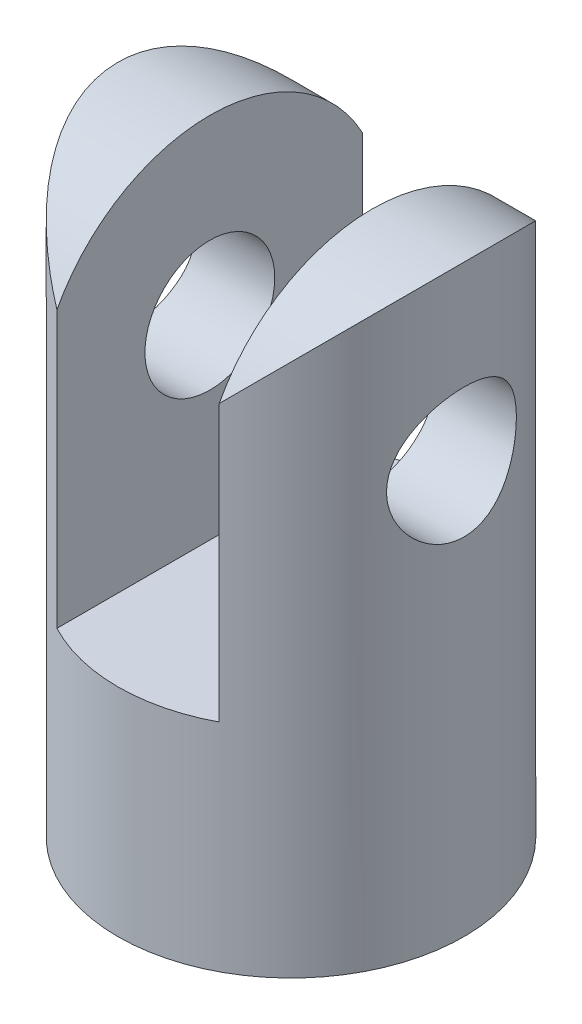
ISO-10303-21;
HEADER;
FILE_DESCRIPTION(('STEP AP214'),'2;1');
FILE_NAME('part.step','',(''),(''),'','','');
FILE_SCHEMA(('AUTOMOTIVE_DESIGN { 1 0 10303 214 1 1 1 1 }'));
ENDSEC;
DATA;
#1=APPLICATION_CONTEXT('core data for automotive mechanical design processes');
#2=APPLICATION_PROTOCOL_DEFINITION('international standard','automotive_design',2000,#1);
#3=PRODUCT_CONTEXT('',#1,'mechanical');
#4=PRODUCT('Part','Part','',(#3));
#5=PRODUCT_RELATED_PRODUCT_CATEGORY('part','',(#4));
#6=PRODUCT_DEFINITION_FORMATION('','',#4);
#7=PRODUCT_DEFINITION_CONTEXT('part definition',#1,'design');
#8=PRODUCT_DEFINITION('design','',#6,#7);
#9=PRODUCT_DEFINITION_SHAPE('','',#8);
#10=(LENGTH_UNIT() NAMED_UNIT(*) SI_UNIT(.MILLI.,.METRE.));
#11=(NAMED_UNIT(*) PLANE_ANGLE_UNIT() SI_UNIT($,.RADIAN.));
#12=(NAMED_UNIT(*) SI_UNIT($,.STERADIAN.) SOLID_ANGLE_UNIT());
#13=UNCERTAINTY_MEASURE_WITH_UNIT(LENGTH_MEASURE(1.E-05),#10,'distance_accuracy_value','');
#14=(GEOMETRIC_REPRESENTATION_CONTEXT(3) GLOBAL_UNCERTAINTY_ASSIGNED_CONTEXT((#13)) GLOBAL_UNIT_ASSIGNED_CONTEXT((#10,
#11,#12)) REPRESENTATION_CONTEXT('',''));
#15=CARTESIAN_POINT('',(0.,0.,0.));
#16=DIRECTION('',(0.,0.,1.));
#17=DIRECTION('',(1.,0.,0.));
#18=AXIS2_PLACEMENT_3D('',#15,#16,#17);
#19=CARTESIAN_POINT('',(0.,9.99999905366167,-2.));
#20=DIRECTION('',(0.,1.,0.));
#21=DIRECTION('',(0.,0.,1.));
#22=AXIS2_PLACEMENT_3D('',#19,#20,#21);
#23=CONICAL_SURFACE('',#22,3.49999522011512,0.785397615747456);
#24=CARTESIAN_POINT('',(0.,9.99999905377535,-2.));
#25=DIRECTION('',(0.,1.,0.));
#26=DIRECTION('',(0.,0.,1.));
#27=AXIS2_PLACEMENT_3D('',#24,#25,#26);
#28=CIRCLE('',#27,3.49999522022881);
#29=CARTESIAN_POINT('',(0.,9.99999905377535,1.49999522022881));
#30=VERTEX_POINT('',#29);
#31=EDGE_CURVE('E77',#30,#30,#28,.T.);
#32=ORIENTED_EDGE('',*,*,#31,.T.);
#33=EDGE_LOOP('',(#32));
#34=FACE_BOUND('',#33,.T.);
#35=CARTESIAN_POINT('',(0.,8.500002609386,-2.));
#36=DIRECTION('',(0.,1.,0.));
#37=DIRECTION('',(0.,0.,1.));
#38=AXIS2_PLACEMENT_3D('',#35,#36,#37);
#39=CIRCLE('',#38,2.);
#40=CARTESIAN_POINT('',(0.,8.500002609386,0.));
#41=VERTEX_POINT('',#40);
#42=EDGE_CURVE('E88',#41,#41,#39,.F.);
#43=ORIENTED_EDGE('',*,*,#42,.T.);
#44=EDGE_LOOP('',(#43));
#45=FACE_BOUND('',#44,.T.);
#46=ADVANCED_FACE('F16',(#34,#45),#23,.F.);
#47=CARTESIAN_POINT('',(-9.6,19.,0.));
#48=DIRECTION('',(1.,0.,0.));
#49=DIRECTION('',(0.,0.,-1.));
#50=AXIS2_PLACEMENT_3D('',#47,#48,#49);
#51=CYLINDRICAL_SURFACE('',#50,8.);
#52=CARTESIAN_POINT('',(-3.749999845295,19.,0.));
#53=DIRECTION('',(1.,0.,0.));
#54=DIRECTION('',(0.,0.,-1.));
#55=AXIS2_PLACEMENT_3D('',#52,#53,#54);
#56=CIRCLE('',#55,8.);
#57=CARTESIAN_POINT('',(-3.74999983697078,22.7499998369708,7.06664709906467));
#58=VERTEX_POINT('',#57);
#59=CARTESIAN_POINT('',(-3.74999968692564,22.7499996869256,-7.06664717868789));
#60=VERTEX_POINT('',#59);
#61=EDGE_CURVE('E21',#58,#60,#56,.F.);
#62=ORIENTED_EDGE('',*,*,#61,.T.);
#63=CARTESIAN_POINT('',(0.,19.,0.));
#64=DIRECTION('',(0.707106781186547,0.707106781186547,0.));
#65=DIRECTION('',(-0.707106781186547,0.707106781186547,0.));
#66=AXIS2_PLACEMENT_3D('',#63,#64,#65);
#67=ELLIPSE('',#66,11.3137084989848,8.);
#68=EDGE_CURVE('E61',#58,#60,#67,.F.);
#69=ORIENTED_EDGE('',*,*,#68,.F.);
#70=EDGE_LOOP('',(#62,#69));
#71=FACE_BOUND('',#70,.T.);
#72=ADVANCED_FACE('F59',(#71),#51,.T.);
#73=CARTESIAN_POINT('',(-3.75,27.,-9.6));
#74=DIRECTION('',(-1.,0.,0.));
#75=DIRECTION('',(0.,0.,1.));
#76=AXIS2_PLACEMENT_3D('',#73,#74,#75);
#77=PLANE('',#76);
#78=CARTESIAN_POINT('',(-3.75,19.,0.));
#79=DIRECTION('',(1.,0.,0.));
#80=DIRECTION('',(0.,0.,-1.));
#81=AXIS2_PLACEMENT_3D('',#78,#79,#80);
#82=CIRCLE('',#81,3.);
#83=CARTESIAN_POINT('',(-3.75,19.,-3.));
#84=VERTEX_POINT('',#83);
#85=EDGE_CURVE('E63',#84,#84,#82,.F.);
#86=ORIENTED_EDGE('',*,*,#85,.T.);
#87=EDGE_LOOP('',(#86));
#88=FACE_BOUND('',#87,.T.);
#89=DIRECTION('',(0.,1.,0.));
#90=VECTOR('',#89,1.);
#91=CARTESIAN_POINT('',(-3.74999952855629,0.,-7.06664726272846));
#92=LINE('',#91,#90);
#93=CARTESIAN_POINT('',(-3.74999972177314,10.,-7.06664716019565));
#94=VERTEX_POINT('',#93);
#95=EDGE_CURVE('E66',#60,#94,#92,.F.);
#96=ORIENTED_EDGE('',*,*,#95,.F.);
#97=ORIENTED_EDGE('',*,*,#61,.F.);
#98=DIRECTION('',(0.,1.,0.));
#99=VECTOR('',#98,1.);
#100=CARTESIAN_POINT('',(-3.74999982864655,0.,7.06664710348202));
#101=LINE('',#100,#99);
#102=CARTESIAN_POINT('',(-3.74999987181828,10.,7.06664708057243));
#103=VERTEX_POINT('',#102);
#104=EDGE_CURVE('E75',#103,#58,#101,.T.);
#105=ORIENTED_EDGE('',*,*,#104,.F.);
#106=DIRECTION('',(0.,0.,-1.));
#107=VECTOR('',#106,1.);
#108=CARTESIAN_POINT('',(-3.74999991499,10.,-9.6));
#109=LINE('',#108,#107);
#110=EDGE_CURVE('E69',#103,#94,#109,.T.);
#111=ORIENTED_EDGE('',*,*,#110,.T.);
#112=EDGE_LOOP('',(#96,#97,#105,#111));
#113=FACE_BOUND('',#112,.T.);
#114=ADVANCED_FACE('F67',(#88,#113),#77,.F.);
#115=CARTESIAN_POINT('',(-9.6,19.,0.));
#116=DIRECTION('',(1.,0.,0.));
#117=DIRECTION('',(0.,0.,-1.));
#118=AXIS2_PLACEMENT_3D('',#115,#116,#117);
#119=CYLINDRICAL_SURFACE('',#118,3.);
#120=ORIENTED_EDGE('',*,*,#85,.F.);
#121=EDGE_LOOP('',(#120));
#122=FACE_BOUND('',#121,.T.);
#123=CARTESIAN_POINT('',(-7.41619848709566,19.,-3.));
#124=CARTESIAN_POINT('',(-7.41620900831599,19.161766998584,-2.9999884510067));
#125=CARTESIAN_POINT('',(-7.42156067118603,19.3236956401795,-2.98684876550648));
#126=CARTESIAN_POINT('',(-7.44229400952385,19.6428323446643,-2.93479153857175));
#127=CARTESIAN_POINT('',(-7.45769160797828,19.8000324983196,-2.89583307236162));
#128=CARTESIAN_POINT('',(-7.49651371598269,20.1047659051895,-2.79378407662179));
#129=CARTESIAN_POINT('',(-7.51991367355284,20.2523271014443,-2.73076729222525));
#130=CARTESIAN_POINT('',(-7.57207117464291,20.534787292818,-2.58261142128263));
#131=CARTESIAN_POINT('',(-7.60082869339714,20.669686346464,-2.49747243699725));
#132=CARTESIAN_POINT('',(-7.66207090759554,20.9297771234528,-2.30293527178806));
#133=CARTESIAN_POINT('',(-7.6946654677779,21.0542515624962,-2.19261232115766));
#134=CARTESIAN_POINT('',(-7.75899363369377,21.2834413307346,-1.95279723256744));
#135=CARTESIAN_POINT('',(-7.79072701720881,21.3881516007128,-1.82330020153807));
#136=CARTESIAN_POINT('',(-7.85105749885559,21.5782790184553,-1.54338924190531));
#137=CARTESIAN_POINT('',(-7.87951124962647,21.662919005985,-1.39241376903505));
#138=CARTESIAN_POINT('',(-7.92876017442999,21.8053024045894,-1.07711141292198));
#139=CARTESIAN_POINT('',(-7.94955801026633,21.8630551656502,-0.912789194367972));
#140=CARTESIAN_POINT('',(-7.98037394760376,21.9475158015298,-0.582978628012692));
#141=CARTESIAN_POINT('',(-7.99081831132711,21.9754552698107,-0.417846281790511));
#142=CARTESIAN_POINT('',(-8.00128028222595,22.00344240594,-0.0849286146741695));
#143=CARTESIAN_POINT('',(-8.00130128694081,22.0034991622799,0.0828558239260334));
#144=CARTESIAN_POINT('',(-7.9911853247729,21.976436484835,0.407486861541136));
#145=CARTESIAN_POINT('',(-7.98155086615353,21.9506614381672,0.564463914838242));
#146=CARTESIAN_POINT('',(-7.95386555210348,21.8749283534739,0.871677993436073));
#147=CARTESIAN_POINT('',(-7.93581407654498,21.8249685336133,1.02191452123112));
#148=CARTESIAN_POINT('',(-7.89275490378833,21.7016575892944,1.3139812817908));
#149=CARTESIAN_POINT('',(-7.86764966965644,21.6279762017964,1.45565710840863));
#150=CARTESIAN_POINT('',(-7.8130249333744,21.4596122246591,1.72497867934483));
#151=CARTESIAN_POINT('',(-7.78350420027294,21.3649237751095,1.85262049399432));
#152=CARTESIAN_POINT('',(-7.72105535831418,21.1507598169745,2.09816242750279));
#153=CARTESIAN_POINT('',(-7.68802893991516,21.0301600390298,2.21505893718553));
#154=CARTESIAN_POINT('',(-7.62365902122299,20.7708645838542,2.42737704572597));
#155=CARTESIAN_POINT('',(-7.59231646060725,20.6321589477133,2.5227867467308));
#156=CARTESIAN_POINT('',(-7.53422933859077,20.3364085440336,2.69138801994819));
#157=CARTESIAN_POINT('',(-7.50760626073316,20.1790170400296,2.76402185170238));
#158=CARTESIAN_POINT('',(-7.47444443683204,19.9348088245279,2.85195371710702));
#159=CARTESIAN_POINT('',(-7.46452220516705,19.8520912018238,2.87775437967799));
#160=CARTESIAN_POINT('',(-7.44725488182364,19.6844945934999,2.92215114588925));
#161=CARTESIAN_POINT('',(-7.43990861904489,19.599616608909,2.9407505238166));
#162=CARTESIAN_POINT('',(-7.42813342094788,19.4293027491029,2.97036830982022));
#163=CARTESIAN_POINT('',(-7.42367360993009,19.3438829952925,2.98146700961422));
#164=CARTESIAN_POINT('',(-7.41770334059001,19.172324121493,2.99628593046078));
#165=CARTESIAN_POINT('',(-7.41619288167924,19.0861850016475,3.00000615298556));
#166=CARTESIAN_POINT('',(-7.41620900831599,18.838233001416,2.9999884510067));
#167=CARTESIAN_POINT('',(-7.42156067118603,18.6763043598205,2.98684876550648));
#168=CARTESIAN_POINT('',(-7.44229400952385,18.3571676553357,2.93479153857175));
#169=CARTESIAN_POINT('',(-7.45769160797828,18.1999675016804,2.89583307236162));
#170=CARTESIAN_POINT('',(-7.49651371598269,17.8952340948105,2.79378407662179));
#171=CARTESIAN_POINT('',(-7.51991367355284,17.7476728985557,2.73076729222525));
#172=CARTESIAN_POINT('',(-7.57207117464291,17.4652127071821,2.58261142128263));
#173=CARTESIAN_POINT('',(-7.60082869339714,17.330313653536,2.49747243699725));
#174=CARTESIAN_POINT('',(-7.66207090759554,17.0702228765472,2.30293527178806));
#175=CARTESIAN_POINT('',(-7.6946654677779,16.9457484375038,2.19261232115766));
#176=CARTESIAN_POINT('',(-7.75899363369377,16.7165586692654,1.95279723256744));
#177=CARTESIAN_POINT('',(-7.79072701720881,16.6118483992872,1.82330020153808));
#178=CARTESIAN_POINT('',(-7.85105749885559,16.4217209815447,1.54338924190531));
#179=CARTESIAN_POINT('',(-7.87951124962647,16.337080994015,1.39241376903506));
#180=CARTESIAN_POINT('',(-7.92876017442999,16.1946975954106,1.07711141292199));
#181=CARTESIAN_POINT('',(-7.94955801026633,16.1369448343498,0.912789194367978));
#182=CARTESIAN_POINT('',(-7.98037394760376,16.0524841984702,0.582978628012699));
#183=CARTESIAN_POINT('',(-7.99081831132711,16.0245447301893,0.417846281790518));
#184=CARTESIAN_POINT('',(-8.00128028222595,15.99655759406,0.0849286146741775));
#185=CARTESIAN_POINT('',(-8.00130128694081,15.9965008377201,-0.0828558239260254));
#186=CARTESIAN_POINT('',(-7.9911853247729,16.023563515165,-0.407486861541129));
#187=CARTESIAN_POINT('',(-7.98155086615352,16.0493385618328,-0.564463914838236));
#188=CARTESIAN_POINT('',(-7.95386555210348,16.1250716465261,-0.871677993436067));
#189=CARTESIAN_POINT('',(-7.93581407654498,16.1750314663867,-1.02191452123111));
#190=CARTESIAN_POINT('',(-7.89275490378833,16.2983424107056,-1.3139812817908));
#191=CARTESIAN_POINT('',(-7.86764966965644,16.3720237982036,-1.45565710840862));
#192=CARTESIAN_POINT('',(-7.8130249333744,16.5403877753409,-1.72497867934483));
#193=CARTESIAN_POINT('',(-7.78350420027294,16.6350762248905,-1.85262049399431));
#194=CARTESIAN_POINT('',(-7.72105535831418,16.8492401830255,-2.09816242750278));
#195=CARTESIAN_POINT('',(-7.68802893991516,16.9698399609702,-2.21505893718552));
#196=CARTESIAN_POINT('',(-7.623659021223,17.2291354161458,-2.42737704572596));
#197=CARTESIAN_POINT('',(-7.59231646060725,17.3678410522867,-2.5227867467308));
#198=CARTESIAN_POINT('',(-7.53422933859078,17.6635914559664,-2.69138801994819));
#199=CARTESIAN_POINT('',(-7.50760626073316,17.8209829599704,-2.76402185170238));
#200=CARTESIAN_POINT('',(-7.47444443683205,18.0651911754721,-2.85195371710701));
#201=CARTESIAN_POINT('',(-7.46452220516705,18.1479087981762,-2.87775437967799));
#202=CARTESIAN_POINT('',(-7.44725488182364,18.3155054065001,-2.92215114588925));
#203=CARTESIAN_POINT('',(-7.43990861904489,18.400383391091,-2.9407505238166));
#204=CARTESIAN_POINT('',(-7.42813342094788,18.5706972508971,-2.97036830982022));
#205=CARTESIAN_POINT('',(-7.42367360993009,18.6561170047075,-2.98146700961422));
#206=CARTESIAN_POINT('',(-7.41770334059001,18.827675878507,-2.99628593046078));
#207=CARTESIAN_POINT('',(-7.41619288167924,18.9138149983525,-3.00000615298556));
#208=CARTESIAN_POINT('',(-7.41619848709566,19.,-3.));
#209=B_SPLINE_CURVE_WITH_KNOTS('',3,(#123,#124,#125,#126,#127,#128,#129,#130,#131,#132,#133,
#134,#135,#136,#137,#138,#139,#140,#141,#142,#143,#144,#145,#146,#147,#148,#149,#150,#151,#152,
#153,#154,#155,#156,#157,#158,#159,#160,#161,#162,#163,#164,#165,#166,#167,#168,#169,#170,#171,
#172,#173,#174,#175,#176,#177,#178,#179,#180,#181,#182,#183,#184,#185,#186,#187,#188,#189,#190,
#191,#192,#193,#194,#195,#196,#197,#198,#199,#200,#201,#202,#203,#204,#205,#206,#207,#208),
.UNSPECIFIED.,.T.,.F.,(4,2,2,2,2,2,2,2,2,2,2,2,2,2,2,2,2,2,2,2,2,2,2,2,2,2,2,2,2,2,2,2,2,2,2,2,
2,2,2,2,2,2,4),(0.,0.484976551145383,0.970723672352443,1.45499365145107,1.93926139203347,
2.44548229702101,2.95183260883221,3.47540168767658,3.99878856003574,4.49960057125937,
5.00024934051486,5.47612880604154,5.95204333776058,6.43489319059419,6.91787790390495,
7.42905646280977,7.9405173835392,8.46366981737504,8.72501356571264,8.98623834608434,
9.24462054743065,9.50300269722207,9.98797924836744,10.4737263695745,10.9579963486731,
11.4422640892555,11.9484849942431,12.4548353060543,12.9784043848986,13.5017912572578,
14.0026032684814,14.5032520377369,14.9791315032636,15.4550460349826,15.9378958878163,
16.420880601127,16.9320591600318,17.4435200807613,17.9666725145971,18.2280162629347,
18.4892410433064,18.7476232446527,19.0060053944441),.UNSPECIFIED.);
#210=CARTESIAN_POINT('',(-7.41619848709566,19.,-3.));
#211=VERTEX_POINT('',#210);
#212=EDGE_CURVE('E72',#211,#211,#209,.T.);
#213=ORIENTED_EDGE('',*,*,#212,.F.);
#214=EDGE_LOOP('',(#213));
#215=FACE_BOUND('',#214,.T.);
#216=ADVANCED_FACE('F126',(#122,#215),#119,.F.);
#217=CARTESIAN_POINT('',(0.,0.,-2.));
#218=DIRECTION('',(0.,1.,0.));
#219=DIRECTION('',(0.,0.,1.));
#220=AXIS2_PLACEMENT_3D('',#217,#218,#219);
#221=CYLINDRICAL_SURFACE('',#220,2.);
#222=ORIENTED_EDGE('',*,*,#42,.F.);
#223=EDGE_LOOP('',(#222));
#224=FACE_BOUND('',#223,.T.);
#225=CARTESIAN_POINT('',(0.,0.,-2.));
#226=DIRECTION('',(0.,1.,0.));
#227=DIRECTION('',(0.,0.,1.));
#228=AXIS2_PLACEMENT_3D('',#225,#226,#227);
#229=CIRCLE('',#228,2.);
#230=CARTESIAN_POINT('',(0.,0.,0.));
#231=VERTEX_POINT('',#230);
#232=EDGE_CURVE('E197',#231,#231,#229,.F.);
#233=ORIENTED_EDGE('',*,*,#232,.T.);
#234=EDGE_LOOP('',(#233));
#235=FACE_BOUND('',#234,.T.);
#236=ADVANCED_FACE('F123',(#224,#235),#221,.F.);
#237=CARTESIAN_POINT('',(-9.6,19.,0.));
#238=DIRECTION('',(1.,0.,0.));
#239=DIRECTION('',(0.,0.,-1.));
#240=AXIS2_PLACEMENT_3D('',#237,#238,#239);
#241=CYLINDRICAL_SURFACE('',#240,8.);
#242=CARTESIAN_POINT('',(3.749999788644,19.,0.));
#243=DIRECTION('',(1.,0.,0.));
#244=DIRECTION('',(0.,0.,-1.));
#245=AXIS2_PLACEMENT_3D('',#242,#243,#244);
#246=CIRCLE('',#245,8.);
#247=CARTESIAN_POINT('',(3.74999989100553,22.7499998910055,-7.06664707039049));
#248=VERTEX_POINT('',#247);
#249=CARTESIAN_POINT('',(3.74999964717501,22.749999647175,7.06664719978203));
#250=VERTEX_POINT('',#249);
#251=EDGE_CURVE('E87',#248,#250,#246,.T.);
#252=ORIENTED_EDGE('',*,*,#251,.T.);
#253=CARTESIAN_POINT('',(0.,19.,0.));
#254=DIRECTION('',(-0.707106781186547,0.707106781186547,0.));
#255=DIRECTION('',(0.707106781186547,0.707106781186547,0.));
#256=AXIS2_PLACEMENT_3D('',#253,#254,#255);
#257=ELLIPSE('',#256,11.3137084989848,8.);
#258=EDGE_CURVE('E195',#248,#250,#257,.F.);
#259=ORIENTED_EDGE('',*,*,#258,.F.);
#260=EDGE_LOOP('',(#252,#259));
#261=FACE_BOUND('',#260,.T.);
#262=ADVANCED_FACE('F119',(#261),#241,.T.);
#263=CARTESIAN_POINT('',(3.75,10.,-9.6));
#264=DIRECTION('',(1.,0.,0.));
#265=DIRECTION('',(0.,0.,-1.));
#266=AXIS2_PLACEMENT_3D('',#263,#264,#265);
#267=PLANE('',#266);
#268=CARTESIAN_POINT('',(3.75,19.,0.));
#269=DIRECTION('',(1.,0.,0.));
#270=DIRECTION('',(0.,0.,-1.));
#271=AXIS2_PLACEMENT_3D('',#268,#269,#270);
#272=CIRCLE('',#271,3.);
#273=CARTESIAN_POINT('',(3.75,19.,-3.));
#274=VERTEX_POINT('',#273);
#275=EDGE_CURVE('E193',#274,#274,#272,.T.);
#276=ORIENTED_EDGE('',*,*,#275,.T.);
#277=EDGE_LOOP('',(#276));
#278=FACE_BOUND('',#277,.T.);
#279=DIRECTION('',(0.,1.,0.));
#280=VECTOR('',#279,1.);
#281=CARTESIAN_POINT('',(3.74999999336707,0.,-7.06664701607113));
#282=LINE('',#281,#280);
#283=CARTESIAN_POINT('',(3.74999999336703,10.,-7.06664701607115));
#284=VERTEX_POINT('',#283);
#285=EDGE_CURVE('E97',#284,#248,#282,.T.);
#286=ORIENTED_EDGE('',*,*,#285,.F.);
#287=DIRECTION('',(0.,0.,-1.));
#288=VECTOR('',#287,1.);
#289=CARTESIAN_POINT('',(3.749999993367,10.,-9.6));
#290=LINE('',#289,#288);
#291=CARTESIAN_POINT('',(3.74999974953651,10.,7.06664714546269));
#292=VERTEX_POINT('',#291);
#293=EDGE_CURVE('E36',#284,#292,#290,.F.);
#294=ORIENTED_EDGE('',*,*,#293,.T.);
#295=DIRECTION('',(0.,1.,0.));
#296=VECTOR('',#295,1.);
#297=CARTESIAN_POINT('',(3.74999950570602,0.,7.06664727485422));
#298=LINE('',#297,#296);
#299=EDGE_CURVE('E212',#250,#292,#298,.F.);
#300=ORIENTED_EDGE('',*,*,#299,.F.);
#301=ORIENTED_EDGE('',*,*,#251,.F.);
#302=EDGE_LOOP('',(#286,#294,#300,#301));
#303=FACE_BOUND('',#302,.T.);
#304=ADVANCED_FACE('F115',(#278,#303),#267,.F.);
#305=CARTESIAN_POINT('',(-3.75,10.,-9.6));
#306=DIRECTION('',(0.,-1.,0.));
#307=DIRECTION('',(0.,0.,-1.));
#308=AXIS2_PLACEMENT_3D('',#305,#306,#307);
#309=PLANE('',#308);
#310=ORIENTED_EDGE('',*,*,#31,.F.);
#311=EDGE_LOOP('',(#310));
#312=FACE_BOUND('',#311,.T.);
#313=CARTESIAN_POINT('',(0.,10.,0.));
#314=DIRECTION('',(0.,1.,0.));
#315=DIRECTION('',(0.,0.,1.));
#316=AXIS2_PLACEMENT_3D('',#313,#314,#315);
#317=CIRCLE('',#316,8.);
#318=EDGE_CURVE('E191',#94,#284,#317,.F.);
#319=ORIENTED_EDGE('',*,*,#318,.F.);
#320=ORIENTED_EDGE('',*,*,#110,.F.);
#321=CARTESIAN_POINT('',(0.,10.,0.));
#322=DIRECTION('',(0.,1.,0.));
#323=DIRECTION('',(0.,0.,1.));
#324=AXIS2_PLACEMENT_3D('',#321,#322,#323);
#325=CIRCLE('',#324,8.);
#326=EDGE_CURVE('E211',#292,#103,#325,.F.);
#327=ORIENTED_EDGE('',*,*,#326,.F.);
#328=ORIENTED_EDGE('',*,*,#293,.F.);
#329=EDGE_LOOP('',(#319,#320,#327,#328));
#330=FACE_BOUND('',#329,.T.);
#331=ADVANCED_FACE('F111',(#312,#330),#309,.F.);
#332=CARTESIAN_POINT('',(0.,0.,0.));
#333=DIRECTION('',(0.,1.,0.));
#334=DIRECTION('',(0.,0.,1.));
#335=AXIS2_PLACEMENT_3D('',#332,#333,#334);
#336=PLANE('',#335);
#337=ORIENTED_EDGE('',*,*,#232,.F.);
#338=EDGE_LOOP('',(#337));
#339=FACE_BOUND('',#338,.T.);
#340=CARTESIAN_POINT('',(0.,0.,0.));
#341=DIRECTION('',(0.,1.,0.));
#342=DIRECTION('',(0.,0.,1.));
#343=AXIS2_PLACEMENT_3D('',#340,#341,#342);
#344=CIRCLE('',#343,8.);
#345=CARTESIAN_POINT('',(0.,0.,8.));
#346=VERTEX_POINT('',#345);
#347=EDGE_CURVE('E27',#346,#346,#344,.T.);
#348=ORIENTED_EDGE('',*,*,#347,.F.);
#349=EDGE_LOOP('',(#348));
#350=FACE_BOUND('',#349,.T.);
#351=ADVANCED_FACE('F107',(#339,#350),#336,.F.);
#352=CARTESIAN_POINT('',(-9.6,19.,0.));
#353=DIRECTION('',(1.,0.,0.));
#354=DIRECTION('',(0.,0.,-1.));
#355=AXIS2_PLACEMENT_3D('',#352,#353,#354);
#356=CYLINDRICAL_SURFACE('',#355,3.);
#357=CARTESIAN_POINT('',(7.41619848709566,19.,3.));
#358=CARTESIAN_POINT('',(7.41620900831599,19.161766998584,2.9999884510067));
#359=CARTESIAN_POINT('',(7.42156067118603,19.3236956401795,2.98684876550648));
#360=CARTESIAN_POINT('',(7.44229400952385,19.6428323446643,2.93479153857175));
#361=CARTESIAN_POINT('',(7.45769160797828,19.8000324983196,2.89583307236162));
#362=CARTESIAN_POINT('',(7.49651371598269,20.1047659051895,2.79378407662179));
#363=CARTESIAN_POINT('',(7.51991367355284,20.2523271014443,2.73076729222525));
#364=CARTESIAN_POINT('',(7.57207117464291,20.534787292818,2.58261142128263));
#365=CARTESIAN_POINT('',(7.60082869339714,20.669686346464,2.49747243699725));
#366=CARTESIAN_POINT('',(7.66207090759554,20.9297771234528,2.30293527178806));
#367=CARTESIAN_POINT('',(7.6946654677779,21.0542515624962,2.19261232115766));
#368=CARTESIAN_POINT('',(7.75899363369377,21.2834413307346,1.95279723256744));
#369=CARTESIAN_POINT('',(7.79072701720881,21.3881516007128,1.82330020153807));
#370=CARTESIAN_POINT('',(7.85105749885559,21.5782790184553,1.54338924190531));
#371=CARTESIAN_POINT('',(7.87951124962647,21.662919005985,1.39241376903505));
#372=CARTESIAN_POINT('',(7.92876017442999,21.8053024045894,1.07711141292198));
#373=CARTESIAN_POINT('',(7.94955801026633,21.8630551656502,0.912789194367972));
#374=CARTESIAN_POINT('',(7.98037394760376,21.9475158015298,0.582978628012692));
#375=CARTESIAN_POINT('',(7.99081831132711,21.9754552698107,0.417846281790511));
#376=CARTESIAN_POINT('',(8.00128028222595,22.00344240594,0.0849286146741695));
#377=CARTESIAN_POINT('',(8.00130128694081,22.0034991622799,-0.0828558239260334));
#378=CARTESIAN_POINT('',(7.9911853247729,21.976436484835,-0.407486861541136));
#379=CARTESIAN_POINT('',(7.98155086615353,21.9506614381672,-0.564463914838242));
#380=CARTESIAN_POINT('',(7.95386555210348,21.8749283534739,-0.871677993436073));
#381=CARTESIAN_POINT('',(7.93581407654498,21.8249685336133,-1.02191452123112));
#382=CARTESIAN_POINT('',(7.89275490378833,21.7016575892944,-1.3139812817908));
#383=CARTESIAN_POINT('',(7.86764966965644,21.6279762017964,-1.45565710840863));
#384=CARTESIAN_POINT('',(7.8130249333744,21.4596122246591,-1.72497867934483));
#385=CARTESIAN_POINT('',(7.78350420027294,21.3649237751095,-1.85262049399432));
#386=CARTESIAN_POINT('',(7.72105535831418,21.1507598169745,-2.09816242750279));
#387=CARTESIAN_POINT('',(7.68802893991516,21.0301600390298,-2.21505893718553));
#388=CARTESIAN_POINT('',(7.62365902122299,20.7708645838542,-2.42737704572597));
#389=CARTESIAN_POINT('',(7.59231646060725,20.6321589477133,-2.5227867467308));
#390=CARTESIAN_POINT('',(7.53422933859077,20.3364085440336,-2.69138801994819));
#391=CARTESIAN_POINT('',(7.50760626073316,20.1790170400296,-2.76402185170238));
#392=CARTESIAN_POINT('',(7.47444443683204,19.9348088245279,-2.85195371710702));
#393=CARTESIAN_POINT('',(7.46452220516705,19.8520912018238,-2.87775437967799));
#394=CARTESIAN_POINT('',(7.44725488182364,19.6844945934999,-2.92215114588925));
#395=CARTESIAN_POINT('',(7.43990861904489,19.599616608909,-2.9407505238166));
#396=CARTESIAN_POINT('',(7.42813342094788,19.4293027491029,-2.97036830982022));
#397=CARTESIAN_POINT('',(7.42367360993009,19.3438829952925,-2.98146700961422));
#398=CARTESIAN_POINT('',(7.41770334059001,19.172324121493,-2.99628593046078));
#399=CARTESIAN_POINT('',(7.41619288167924,19.0861850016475,-3.00000615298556));
#400=CARTESIAN_POINT('',(7.41620900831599,18.838233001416,-2.9999884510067));
#401=CARTESIAN_POINT('',(7.42156067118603,18.6763043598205,-2.98684876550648));
#402=CARTESIAN_POINT('',(7.44229400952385,18.3571676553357,-2.93479153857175));
#403=CARTESIAN_POINT('',(7.45769160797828,18.1999675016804,-2.89583307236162));
#404=CARTESIAN_POINT('',(7.49651371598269,17.8952340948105,-2.79378407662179));
#405=CARTESIAN_POINT('',(7.51991367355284,17.7476728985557,-2.73076729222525));
#406=CARTESIAN_POINT('',(7.57207117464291,17.4652127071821,-2.58261142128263));
#407=CARTESIAN_POINT('',(7.60082869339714,17.330313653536,-2.49747243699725));
#408=CARTESIAN_POINT('',(7.66207090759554,17.0702228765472,-2.30293527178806));
#409=CARTESIAN_POINT('',(7.6946654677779,16.9457484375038,-2.19261232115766));
#410=CARTESIAN_POINT('',(7.75899363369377,16.7165586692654,-1.95279723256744));
#411=CARTESIAN_POINT('',(7.79072701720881,16.6118483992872,-1.82330020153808));
#412=CARTESIAN_POINT('',(7.85105749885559,16.4217209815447,-1.54338924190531));
#413=CARTESIAN_POINT('',(7.87951124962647,16.337080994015,-1.39241376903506));
#414=CARTESIAN_POINT('',(7.92876017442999,16.1946975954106,-1.07711141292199));
#415=CARTESIAN_POINT('',(7.94955801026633,16.1369448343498,-0.912789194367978));
#416=CARTESIAN_POINT('',(7.98037394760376,16.0524841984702,-0.582978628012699));
#417=CARTESIAN_POINT('',(7.99081831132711,16.0245447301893,-0.417846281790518));
#418=CARTESIAN_POINT('',(8.00128028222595,15.99655759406,-0.0849286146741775));
#419=CARTESIAN_POINT('',(8.00130128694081,15.9965008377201,0.0828558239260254));
#420=CARTESIAN_POINT('',(7.9911853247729,16.023563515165,0.407486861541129));
#421=CARTESIAN_POINT('',(7.98155086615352,16.0493385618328,0.564463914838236));
#422=CARTESIAN_POINT('',(7.95386555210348,16.1250716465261,0.871677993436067));
#423=CARTESIAN_POINT('',(7.93581407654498,16.1750314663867,1.02191452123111));
#424=CARTESIAN_POINT('',(7.89275490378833,16.2983424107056,1.3139812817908));
#425=CARTESIAN_POINT('',(7.86764966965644,16.3720237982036,1.45565710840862));
#426=CARTESIAN_POINT('',(7.8130249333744,16.5403877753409,1.72497867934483));
#427=CARTESIAN_POINT('',(7.78350420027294,16.6350762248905,1.85262049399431));
#428=CARTESIAN_POINT('',(7.72105535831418,16.8492401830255,2.09816242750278));
#429=CARTESIAN_POINT('',(7.68802893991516,16.9698399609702,2.21505893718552));
#430=CARTESIAN_POINT('',(7.623659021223,17.2291354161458,2.42737704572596));
#431=CARTESIAN_POINT('',(7.59231646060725,17.3678410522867,2.5227867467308));
#432=CARTESIAN_POINT('',(7.53422933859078,17.6635914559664,2.69138801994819));
#433=CARTESIAN_POINT('',(7.50760626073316,17.8209829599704,2.76402185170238));
#434=CARTESIAN_POINT('',(7.47444443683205,18.0651911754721,2.85195371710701));
#435=CARTESIAN_POINT('',(7.46452220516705,18.1479087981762,2.87775437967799));
#436=CARTESIAN_POINT('',(7.44725488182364,18.3155054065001,2.92215114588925));
#437=CARTESIAN_POINT('',(7.43990861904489,18.400383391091,2.9407505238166));
#438=CARTESIAN_POINT('',(7.42813342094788,18.5706972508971,2.97036830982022));
#439=CARTESIAN_POINT('',(7.42367360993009,18.6561170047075,2.98146700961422));
#440=CARTESIAN_POINT('',(7.41770334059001,18.827675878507,2.99628593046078));
#441=CARTESIAN_POINT('',(7.41619288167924,18.9138149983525,3.00000615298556));
#442=CARTESIAN_POINT('',(7.41619848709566,19.,3.));
#443=B_SPLINE_CURVE_WITH_KNOTS('',3,(#357,#358,#359,#360,#361,#362,#363,#364,#365,#366,#367,
#368,#369,#370,#371,#372,#373,#374,#375,#376,#377,#378,#379,#380,#381,#382,#383,#384,#385,#386,
#387,#388,#389,#390,#391,#392,#393,#394,#395,#396,#397,#398,#399,#400,#401,#402,#403,#404,#405,
#406,#407,#408,#409,#410,#411,#412,#413,#414,#415,#416,#417,#418,#419,#420,#421,#422,#423,#424,
#425,#426,#427,#428,#429,#430,#431,#432,#433,#434,#435,#436,#437,#438,#439,#440,#441,#442),
.UNSPECIFIED.,.T.,.F.,(4,2,2,2,2,2,2,2,2,2,2,2,2,2,2,2,2,2,2,2,2,2,2,2,2,2,2,2,2,2,2,2,2,2,2,2,
2,2,2,2,2,2,4),(0.,0.484976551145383,0.970723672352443,1.45499365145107,1.93926139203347,
2.44548229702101,2.95183260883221,3.47540168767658,3.99878856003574,4.49960057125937,
5.00024934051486,5.47612880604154,5.95204333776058,6.43489319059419,6.91787790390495,
7.42905646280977,7.9405173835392,8.46366981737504,8.72501356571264,8.98623834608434,
9.24462054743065,9.50300269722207,9.98797924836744,10.4737263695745,10.9579963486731,
11.4422640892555,11.9484849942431,12.4548353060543,12.9784043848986,13.5017912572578,
14.0026032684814,14.5032520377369,14.9791315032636,15.4550460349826,15.9378958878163,
16.420880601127,16.9320591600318,17.4435200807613,17.9666725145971,18.2280162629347,
18.4892410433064,18.7476232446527,19.0060053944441),.UNSPECIFIED.);
#444=CARTESIAN_POINT('',(7.41619848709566,19.,3.));
#445=VERTEX_POINT('',#444);
#446=EDGE_CURVE('E11',#445,#445,#443,.T.);
#447=ORIENTED_EDGE('',*,*,#446,.F.);
#448=EDGE_LOOP('',(#447));
#449=FACE_BOUND('',#448,.T.);
#450=ORIENTED_EDGE('',*,*,#275,.F.);
#451=EDGE_LOOP('',(#450));
#452=FACE_BOUND('',#451,.T.);
#453=ADVANCED_FACE('F103',(#449,#452),#356,.F.);
#454=CARTESIAN_POINT('',(0.,0.,0.));
#455=DIRECTION('',(0.,1.,0.));
#456=DIRECTION('',(0.,0.,1.));
#457=AXIS2_PLACEMENT_3D('',#454,#455,#456);
#458=CYLINDRICAL_SURFACE('',#457,8.);
#459=ORIENTED_EDGE('',*,*,#95,.T.);
#460=ORIENTED_EDGE('',*,*,#318,.T.);
#461=ORIENTED_EDGE('',*,*,#285,.T.);
#462=ORIENTED_EDGE('',*,*,#258,.T.);
#463=ORIENTED_EDGE('',*,*,#299,.T.);
#464=ORIENTED_EDGE('',*,*,#326,.T.);
#465=ORIENTED_EDGE('',*,*,#104,.T.);
#466=ORIENTED_EDGE('',*,*,#68,.T.);
#467=EDGE_LOOP('',(#459,#460,#461,#462,#463,#464,#465,#466));
#468=FACE_BOUND('',#467,.T.);
#469=ORIENTED_EDGE('',*,*,#446,.T.);
#470=EDGE_LOOP('',(#469));
#471=FACE_BOUND('',#470,.T.);
#472=ORIENTED_EDGE('',*,*,#347,.T.);
#473=EDGE_LOOP('',(#472));
#474=FACE_BOUND('',#473,.T.);
#475=ORIENTED_EDGE('',*,*,#212,.T.);
#476=EDGE_LOOP('',(#475));
#477=FACE_BOUND('',#476,.T.);
#478=ADVANCED_FACE('F18',(#468,#471,#474,#477),#458,.T.);
#479=CLOSED_SHELL('',(#46,#72,#114,#216,#236,#262,#304,#331,#351,#453,#478));
#480=MANIFOLD_SOLID_BREP('B1',#479);
#481=ADVANCED_BREP_SHAPE_REPRESENTATION('',(#18,#480),#14);
#482=SHAPE_DEFINITION_REPRESENTATION(#9,#481);
ENDSEC;
END-ISO-10303-21;
